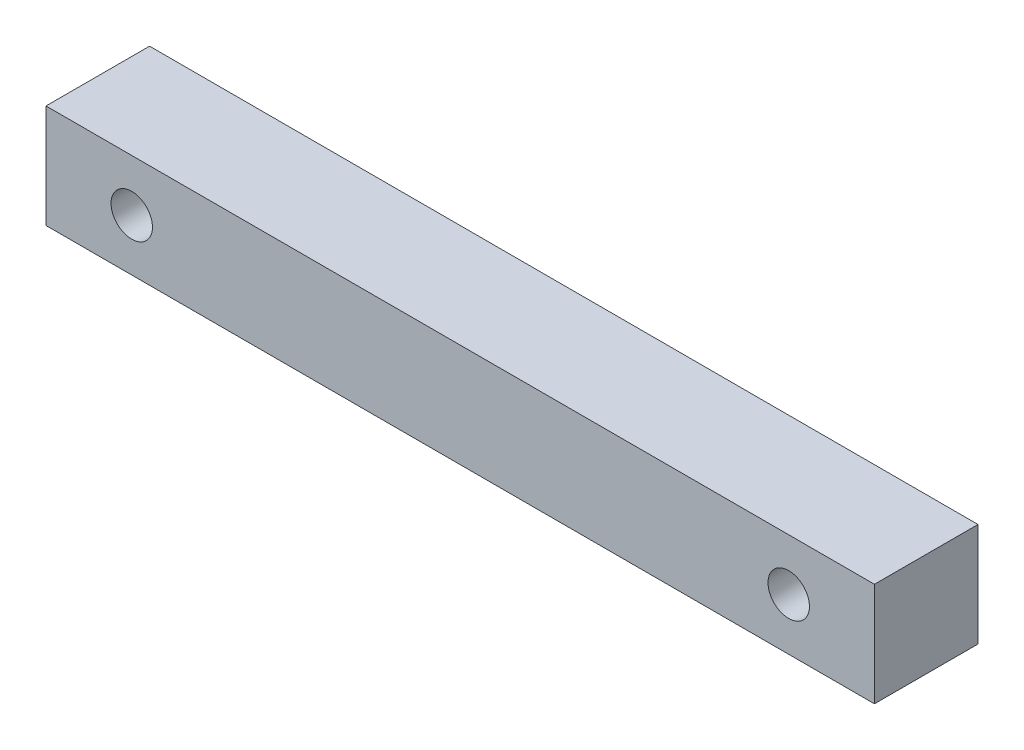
ISO-10303-21;
HEADER;
FILE_DESCRIPTION(('STEP AP214'),'2;1');
FILE_NAME('part.step','',(''),(''),'','','');
FILE_SCHEMA(('AUTOMOTIVE_DESIGN { 1 0 10303 214 1 1 1 1 }'));
ENDSEC;
DATA;
#1=APPLICATION_CONTEXT('core data for automotive mechanical design processes');
#2=APPLICATION_PROTOCOL_DEFINITION('international standard','automotive_design',2000,#1);
#3=PRODUCT_CONTEXT('',#1,'mechanical');
#4=PRODUCT('Part','Part','',(#3));
#5=PRODUCT_RELATED_PRODUCT_CATEGORY('part','',(#4));
#6=PRODUCT_DEFINITION_FORMATION('','',#4);
#7=PRODUCT_DEFINITION_CONTEXT('part definition',#1,'design');
#8=PRODUCT_DEFINITION('design','',#6,#7);
#9=PRODUCT_DEFINITION_SHAPE('','',#8);
#10=(LENGTH_UNIT() NAMED_UNIT(*) SI_UNIT(.MILLI.,.METRE.));
#11=(NAMED_UNIT(*) PLANE_ANGLE_UNIT() SI_UNIT($,.RADIAN.));
#12=(NAMED_UNIT(*) SI_UNIT($,.STERADIAN.) SOLID_ANGLE_UNIT());
#13=UNCERTAINTY_MEASURE_WITH_UNIT(LENGTH_MEASURE(1.E-05),#10,'distance_accuracy_value','');
#14=(GEOMETRIC_REPRESENTATION_CONTEXT(3) GLOBAL_UNCERTAINTY_ASSIGNED_CONTEXT((#13)) GLOBAL_UNIT_ASSIGNED_CONTEXT((#10,
#11,#12)) REPRESENTATION_CONTEXT('',''));
#15=CARTESIAN_POINT('',(0.,0.,0.));
#16=DIRECTION('',(0.,0.,1.));
#17=DIRECTION('',(1.,0.,0.));
#18=AXIS2_PLACEMENT_3D('',#15,#16,#17);
#19=CARTESIAN_POINT('',(-20.,2.5,5.));
#20=DIRECTION('',(1.,0.,0.));
#21=DIRECTION('',(0.,0.,-1.));
#22=AXIS2_PLACEMENT_3D('',#19,#20,#21);
#23=PLANE('',#22);
#24=DIRECTION('',(0.,-1.,0.));
#25=VECTOR('',#24,1.);
#26=CARTESIAN_POINT('',(-20.,2.5,0.));
#27=LINE('',#26,#25);
#28=CARTESIAN_POINT('',(-20.,2.5,0.));
#29=VERTEX_POINT('',#28);
#30=CARTESIAN_POINT('',(-20.,-2.5,0.));
#31=VERTEX_POINT('',#30);
#32=EDGE_CURVE('E98',#29,#31,#27,.T.);
#33=ORIENTED_EDGE('',*,*,#32,.T.);
#34=DIRECTION('',(0.,0.,-1.));
#35=VECTOR('',#34,1.);
#36=CARTESIAN_POINT('',(-20.,-2.5,5.));
#37=LINE('',#36,#35);
#38=CARTESIAN_POINT('',(-20.,-2.5,5.));
#39=VERTEX_POINT('',#38);
#40=EDGE_CURVE('E11',#39,#31,#37,.T.);
#41=ORIENTED_EDGE('',*,*,#40,.F.);
#42=DIRECTION('',(0.,-1.,0.));
#43=VECTOR('',#42,1.);
#44=CARTESIAN_POINT('',(-20.,2.5,5.));
#45=LINE('',#44,#43);
#46=CARTESIAN_POINT('',(-20.,2.5,5.));
#47=VERTEX_POINT('',#46);
#48=EDGE_CURVE('E86',#47,#39,#45,.T.);
#49=ORIENTED_EDGE('',*,*,#48,.F.);
#50=DIRECTION('',(0.,0.,-1.));
#51=VECTOR('',#50,1.);
#52=CARTESIAN_POINT('',(-20.,2.5,5.));
#53=LINE('',#52,#51);
#54=EDGE_CURVE('E94',#47,#29,#53,.T.);
#55=ORIENTED_EDGE('',*,*,#54,.T.);
#56=EDGE_LOOP('',(#33,#41,#49,#55));
#57=FACE_BOUND('',#56,.T.);
#58=ADVANCED_FACE('F35',(#57),#23,.F.);
#59=CARTESIAN_POINT('',(-20.,-2.5,5.));
#60=DIRECTION('',(0.,1.,0.));
#61=DIRECTION('',(0.,0.,1.));
#62=AXIS2_PLACEMENT_3D('',#59,#60,#61);
#63=PLANE('',#62);
#64=DIRECTION('',(1.,0.,0.));
#65=VECTOR('',#64,1.);
#66=CARTESIAN_POINT('',(-20.,-2.5,0.));
#67=LINE('',#66,#65);
#68=CARTESIAN_POINT('',(20.,-2.5,0.));
#69=VERTEX_POINT('',#68);
#70=EDGE_CURVE('E90',#31,#69,#67,.T.);
#71=ORIENTED_EDGE('',*,*,#70,.T.);
#72=DIRECTION('',(0.,0.,-1.));
#73=VECTOR('',#72,1.);
#74=CARTESIAN_POINT('',(20.,-2.5,5.));
#75=LINE('',#74,#73);
#76=CARTESIAN_POINT('',(20.,-2.5,5.));
#77=VERTEX_POINT('',#76);
#78=EDGE_CURVE('E43',#77,#69,#75,.T.);
#79=ORIENTED_EDGE('',*,*,#78,.F.);
#80=DIRECTION('',(1.,0.,0.));
#81=VECTOR('',#80,1.);
#82=CARTESIAN_POINT('',(-20.,-2.5,5.));
#83=LINE('',#82,#81);
#84=EDGE_CURVE('E81',#39,#77,#83,.T.);
#85=ORIENTED_EDGE('',*,*,#84,.F.);
#86=ORIENTED_EDGE('',*,*,#40,.T.);
#87=EDGE_LOOP('',(#71,#79,#85,#86));
#88=FACE_BOUND('',#87,.T.);
#89=ADVANCED_FACE('F89',(#88),#63,.F.);
#90=CARTESIAN_POINT('',(20.,2.5,5.));
#91=DIRECTION('',(-1.,0.,0.));
#92=DIRECTION('',(0.,0.,1.));
#93=AXIS2_PLACEMENT_3D('',#90,#91,#92);
#94=PLANE('',#93);
#95=DIRECTION('',(0.,1.,0.));
#96=VECTOR('',#95,1.);
#97=CARTESIAN_POINT('',(20.,2.5,0.));
#98=LINE('',#97,#96);
#99=CARTESIAN_POINT('',(20.,2.5,0.));
#100=VERTEX_POINT('',#99);
#101=EDGE_CURVE('E68',#69,#100,#98,.T.);
#102=ORIENTED_EDGE('',*,*,#101,.T.);
#103=DIRECTION('',(0.,0.,-1.));
#104=VECTOR('',#103,1.);
#105=CARTESIAN_POINT('',(20.,2.5,5.));
#106=LINE('',#105,#104);
#107=CARTESIAN_POINT('',(20.,2.5,5.));
#108=VERTEX_POINT('',#107);
#109=EDGE_CURVE('E91',#108,#100,#106,.T.);
#110=ORIENTED_EDGE('',*,*,#109,.F.);
#111=DIRECTION('',(0.,1.,0.));
#112=VECTOR('',#111,1.);
#113=CARTESIAN_POINT('',(20.,2.5,5.));
#114=LINE('',#113,#112);
#115=EDGE_CURVE('E84',#77,#108,#114,.T.);
#116=ORIENTED_EDGE('',*,*,#115,.F.);
#117=ORIENTED_EDGE('',*,*,#78,.T.);
#118=EDGE_LOOP('',(#102,#110,#116,#117));
#119=FACE_BOUND('',#118,.T.);
#120=ADVANCED_FACE('F92',(#119),#94,.F.);
#121=CARTESIAN_POINT('',(-20.,2.5,5.));
#122=DIRECTION('',(0.,-1.,0.));
#123=DIRECTION('',(0.,0.,-1.));
#124=AXIS2_PLACEMENT_3D('',#121,#122,#123);
#125=PLANE('',#124);
#126=DIRECTION('',(-1.,0.,0.));
#127=VECTOR('',#126,1.);
#128=CARTESIAN_POINT('',(-20.,2.5,0.));
#129=LINE('',#128,#127);
#130=EDGE_CURVE('E74',#100,#29,#129,.T.);
#131=ORIENTED_EDGE('',*,*,#130,.T.);
#132=ORIENTED_EDGE('',*,*,#54,.F.);
#133=DIRECTION('',(-1.,0.,0.));
#134=VECTOR('',#133,1.);
#135=CARTESIAN_POINT('',(-20.,2.5,5.));
#136=LINE('',#135,#134);
#137=EDGE_CURVE('E51',#108,#47,#136,.T.);
#138=ORIENTED_EDGE('',*,*,#137,.F.);
#139=ORIENTED_EDGE('',*,*,#109,.T.);
#140=EDGE_LOOP('',(#131,#132,#138,#139));
#141=FACE_BOUND('',#140,.T.);
#142=ADVANCED_FACE('F106',(#141),#125,.F.);
#143=CARTESIAN_POINT('',(0.,0.,5.));
#144=DIRECTION('',(0.,0.,1.));
#145=DIRECTION('',(1.,0.,0.));
#146=AXIS2_PLACEMENT_3D('',#143,#144,#145);
#147=PLANE('',#146);
#148=CARTESIAN_POINT('',(15.86034517,0.,5.));
#149=DIRECTION('',(0.,0.,1.));
#150=DIRECTION('',(1.,0.,0.));
#151=AXIS2_PLACEMENT_3D('',#148,#149,#150);
#152=CIRCLE('',#151,1.);
#153=CARTESIAN_POINT('',(16.86034517,0.,5.));
#154=VERTEX_POINT('',#153);
#155=EDGE_CURVE('E118',#154,#154,#152,.T.);
#156=ORIENTED_EDGE('',*,*,#155,.F.);
#157=EDGE_LOOP('',(#156));
#158=FACE_BOUND('',#157,.T.);
#159=CARTESIAN_POINT('',(-15.86034517,0.,5.));
#160=DIRECTION('',(0.,0.,1.));
#161=DIRECTION('',(1.,0.,0.));
#162=AXIS2_PLACEMENT_3D('',#159,#160,#161);
#163=CIRCLE('',#162,1.);
#164=CARTESIAN_POINT('',(-14.86034517,0.,5.));
#165=VERTEX_POINT('',#164);
#166=EDGE_CURVE('E112',#165,#165,#163,.T.);
#167=ORIENTED_EDGE('',*,*,#166,.F.);
#168=EDGE_LOOP('',(#167));
#169=FACE_BOUND('',#168,.T.);
#170=ORIENTED_EDGE('',*,*,#48,.T.);
#171=ORIENTED_EDGE('',*,*,#84,.T.);
#172=ORIENTED_EDGE('',*,*,#115,.T.);
#173=ORIENTED_EDGE('',*,*,#137,.T.);
#174=EDGE_LOOP('',(#170,#171,#172,#173));
#175=FACE_BOUND('',#174,.T.);
#176=ADVANCED_FACE('F82',(#158,#169,#175),#147,.T.);
#177=CARTESIAN_POINT('',(0.,0.,0.));
#178=DIRECTION('',(0.,0.,1.));
#179=DIRECTION('',(1.,0.,0.));
#180=AXIS2_PLACEMENT_3D('',#177,#178,#179);
#181=PLANE('',#180);
#182=CARTESIAN_POINT('',(15.86034517,0.,0.));
#183=DIRECTION('',(0.,0.,1.));
#184=DIRECTION('',(1.,0.,0.));
#185=AXIS2_PLACEMENT_3D('',#182,#183,#184);
#186=CIRCLE('',#185,1.);
#187=CARTESIAN_POINT('',(16.86034517,0.,0.));
#188=VERTEX_POINT('',#187);
#189=EDGE_CURVE('E115',#188,#188,#186,.T.);
#190=ORIENTED_EDGE('',*,*,#189,.T.);
#191=EDGE_LOOP('',(#190));
#192=FACE_BOUND('',#191,.T.);
#193=CARTESIAN_POINT('',(-15.86034517,0.,0.));
#194=DIRECTION('',(0.,0.,1.));
#195=DIRECTION('',(1.,0.,0.));
#196=AXIS2_PLACEMENT_3D('',#193,#194,#195);
#197=CIRCLE('',#196,1.);
#198=CARTESIAN_POINT('',(-14.86034517,0.,0.));
#199=VERTEX_POINT('',#198);
#200=EDGE_CURVE('E101',#199,#199,#197,.T.);
#201=ORIENTED_EDGE('',*,*,#200,.T.);
#202=EDGE_LOOP('',(#201));
#203=FACE_BOUND('',#202,.T.);
#204=ORIENTED_EDGE('',*,*,#32,.F.);
#205=ORIENTED_EDGE('',*,*,#130,.F.);
#206=ORIENTED_EDGE('',*,*,#101,.F.);
#207=ORIENTED_EDGE('',*,*,#70,.F.);
#208=EDGE_LOOP('',(#204,#205,#206,#207));
#209=FACE_BOUND('',#208,.T.);
#210=ADVANCED_FACE('F109',(#192,#203,#209),#181,.F.);
#211=CARTESIAN_POINT('',(-15.86034517,0.,0.));
#212=DIRECTION('',(0.,0.,1.));
#213=DIRECTION('',(1.,0.,0.));
#214=AXIS2_PLACEMENT_3D('',#211,#212,#213);
#215=CYLINDRICAL_SURFACE('',#214,1.);
#216=ORIENTED_EDGE('',*,*,#200,.F.);
#217=EDGE_LOOP('',(#216));
#218=FACE_BOUND('',#217,.T.);
#219=ORIENTED_EDGE('',*,*,#166,.T.);
#220=EDGE_LOOP('',(#219));
#221=FACE_BOUND('',#220,.T.);
#222=ADVANCED_FACE('F129',(#218,#221),#215,.F.);
#223=CARTESIAN_POINT('',(15.86034517,0.,0.));
#224=DIRECTION('',(0.,0.,1.));
#225=DIRECTION('',(1.,0.,0.));
#226=AXIS2_PLACEMENT_3D('',#223,#224,#225);
#227=CYLINDRICAL_SURFACE('',#226,1.);
#228=ORIENTED_EDGE('',*,*,#189,.F.);
#229=EDGE_LOOP('',(#228));
#230=FACE_BOUND('',#229,.T.);
#231=ORIENTED_EDGE('',*,*,#155,.T.);
#232=EDGE_LOOP('',(#231));
#233=FACE_BOUND('',#232,.T.);
#234=ADVANCED_FACE('F126',(#230,#233),#227,.F.);
#235=CLOSED_SHELL('',(#58,#89,#120,#142,#176,#210,#222,#234));
#236=MANIFOLD_SOLID_BREP('B2',#235);
#237=ADVANCED_BREP_SHAPE_REPRESENTATION('',(#18,#236),#14);
#238=SHAPE_DEFINITION_REPRESENTATION(#9,#237);
ENDSEC;
END-ISO-10303-21;
